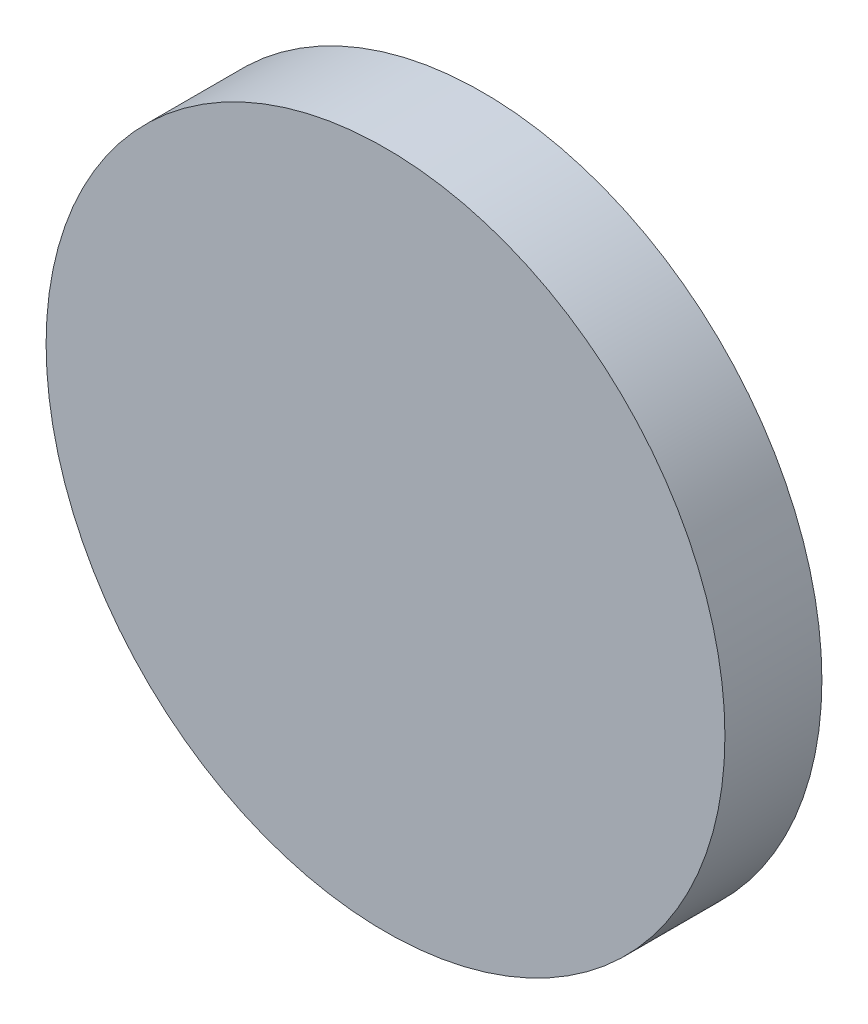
ISO-10303-21;
HEADER;
FILE_DESCRIPTION(('STEP AP214'),'2;1');
FILE_NAME('part.step','',(''),(''),'','','');
FILE_SCHEMA(('AUTOMOTIVE_DESIGN { 1 0 10303 214 1 1 1 1 }'));
ENDSEC;
DATA;
#1=APPLICATION_CONTEXT('core data for automotive mechanical design processes');
#2=APPLICATION_PROTOCOL_DEFINITION('international standard','automotive_design',2000,#1);
#3=PRODUCT_CONTEXT('',#1,'mechanical');
#4=PRODUCT('Part','Part','',(#3));
#5=PRODUCT_RELATED_PRODUCT_CATEGORY('part','',(#4));
#6=PRODUCT_DEFINITION_FORMATION('','',#4);
#7=PRODUCT_DEFINITION_CONTEXT('part definition',#1,'design');
#8=PRODUCT_DEFINITION('design','',#6,#7);
#9=PRODUCT_DEFINITION_SHAPE('','',#8);
#10=(LENGTH_UNIT() NAMED_UNIT(*) SI_UNIT(.MILLI.,.METRE.));
#11=(NAMED_UNIT(*) PLANE_ANGLE_UNIT() SI_UNIT($,.RADIAN.));
#12=(NAMED_UNIT(*) SI_UNIT($,.STERADIAN.) SOLID_ANGLE_UNIT());
#13=UNCERTAINTY_MEASURE_WITH_UNIT(LENGTH_MEASURE(1.E-05),#10,'distance_accuracy_value','');
#14=(GEOMETRIC_REPRESENTATION_CONTEXT(3) GLOBAL_UNCERTAINTY_ASSIGNED_CONTEXT((#13)) GLOBAL_UNIT_ASSIGNED_CONTEXT((#10,
#11,#12)) REPRESENTATION_CONTEXT('',''));
#15=CARTESIAN_POINT('',(0.,0.,0.));
#16=DIRECTION('',(0.,0.,1.));
#17=DIRECTION('',(1.,0.,0.));
#18=AXIS2_PLACEMENT_3D('',#15,#16,#17);
#19=CARTESIAN_POINT('',(0.,0.,1.));
#20=DIRECTION('',(0.,0.,-1.));
#21=DIRECTION('',(-1.,0.,0.));
#22=AXIS2_PLACEMENT_3D('',#19,#20,#21);
#23=CYLINDRICAL_SURFACE('',#22,3.5);
#24=CARTESIAN_POINT('',(0.,0.,1.));
#25=DIRECTION('',(0.,0.,1.));
#26=DIRECTION('',(1.,0.,0.));
#27=AXIS2_PLACEMENT_3D('',#24,#25,#26);
#28=CIRCLE('',#27,3.5);
#29=CARTESIAN_POINT('',(3.5,0.,1.));
#30=VERTEX_POINT('',#29);
#31=EDGE_CURVE('E10',#30,#30,#28,.T.);
#32=ORIENTED_EDGE('',*,*,#31,.F.);
#33=EDGE_LOOP('',(#32));
#34=FACE_BOUND('',#33,.T.);
#35=CARTESIAN_POINT('',(0.,0.,0.));
#36=DIRECTION('',(0.,0.,1.));
#37=DIRECTION('',(1.,0.,0.));
#38=AXIS2_PLACEMENT_3D('',#35,#36,#37);
#39=CIRCLE('',#38,3.5);
#40=CARTESIAN_POINT('',(3.5,0.,0.));
#41=VERTEX_POINT('',#40);
#42=EDGE_CURVE('E40',#41,#41,#39,.T.);
#43=ORIENTED_EDGE('',*,*,#42,.T.);
#44=EDGE_LOOP('',(#43));
#45=FACE_BOUND('',#44,.T.);
#46=ADVANCED_FACE('F37',(#34,#45),#23,.T.);
#47=CARTESIAN_POINT('',(0.,0.,1.));
#48=DIRECTION('',(0.,0.,1.));
#49=DIRECTION('',(1.,0.,0.));
#50=AXIS2_PLACEMENT_3D('',#47,#48,#49);
#51=PLANE('',#50);
#52=ORIENTED_EDGE('',*,*,#31,.T.);
#53=EDGE_LOOP('',(#52));
#54=FACE_BOUND('',#53,.T.);
#55=ADVANCED_FACE('F52',(#54),#51,.T.);
#56=CARTESIAN_POINT('',(0.,0.,0.));
#57=DIRECTION('',(0.,0.,1.));
#58=DIRECTION('',(1.,0.,0.));
#59=AXIS2_PLACEMENT_3D('',#56,#57,#58);
#60=PLANE('',#59);
#61=ORIENTED_EDGE('',*,*,#42,.F.);
#62=EDGE_LOOP('',(#61));
#63=FACE_BOUND('',#62,.T.);
#64=ADVANCED_FACE('F50',(#63),#60,.F.);
#65=CLOSED_SHELL('',(#46,#55,#64));
#66=MANIFOLD_SOLID_BREP('B2',#65);
#67=ADVANCED_BREP_SHAPE_REPRESENTATION('',(#18,#66),#14);
#68=SHAPE_DEFINITION_REPRESENTATION(#9,#67);
ENDSEC;
END-ISO-10303-21;
